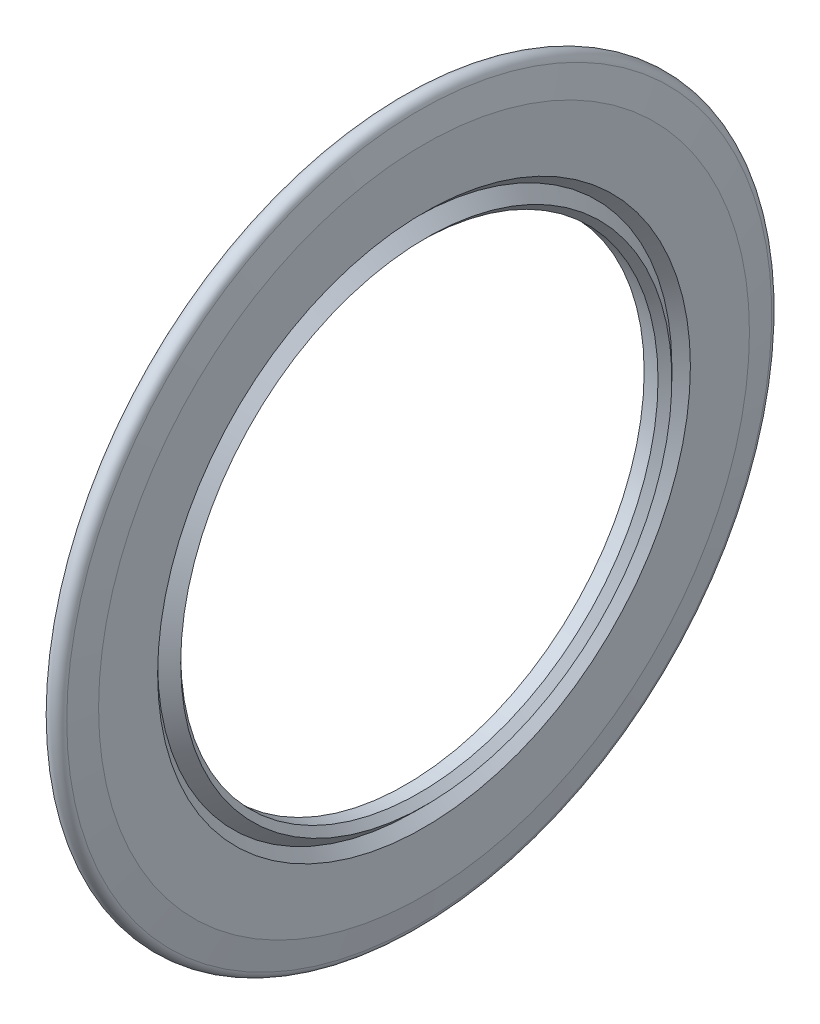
ISO-10303-21;
HEADER;
FILE_DESCRIPTION(('STEP AP214'),'2;1');
FILE_NAME('part.step','',(''),(''),'','','');
FILE_SCHEMA(('AUTOMOTIVE_DESIGN { 1 0 10303 214 1 1 1 1 }'));
ENDSEC;
DATA;
#1=APPLICATION_CONTEXT('core data for automotive mechanical design processes');
#2=APPLICATION_PROTOCOL_DEFINITION('international standard','automotive_design',2000,#1);
#3=PRODUCT_CONTEXT('',#1,'mechanical');
#4=PRODUCT('Part','Part','',(#3));
#5=PRODUCT_RELATED_PRODUCT_CATEGORY('part','',(#4));
#6=PRODUCT_DEFINITION_FORMATION('','',#4);
#7=PRODUCT_DEFINITION_CONTEXT('part definition',#1,'design');
#8=PRODUCT_DEFINITION('design','',#6,#7);
#9=PRODUCT_DEFINITION_SHAPE('','',#8);
#10=(LENGTH_UNIT() NAMED_UNIT(*) SI_UNIT(.MILLI.,.METRE.));
#11=(NAMED_UNIT(*) PLANE_ANGLE_UNIT() SI_UNIT($,.RADIAN.));
#12=(NAMED_UNIT(*) SI_UNIT($,.STERADIAN.) SOLID_ANGLE_UNIT());
#13=UNCERTAINTY_MEASURE_WITH_UNIT(LENGTH_MEASURE(1.E-05),#10,'distance_accuracy_value','');
#14=(GEOMETRIC_REPRESENTATION_CONTEXT(3) GLOBAL_UNCERTAINTY_ASSIGNED_CONTEXT((#13)) GLOBAL_UNIT_ASSIGNED_CONTEXT((#10,
#11,#12)) REPRESENTATION_CONTEXT('',''));
#15=CARTESIAN_POINT('',(0.,0.,0.));
#16=DIRECTION('',(0.,0.,1.));
#17=DIRECTION('',(1.,0.,0.));
#18=AXIS2_PLACEMENT_3D('',#15,#16,#17);
#19=CARTESIAN_POINT('',(0.14,0.,0.));
#20=DIRECTION('',(-1.,0.,0.));
#21=DIRECTION('',(0.,0.,1.));
#22=AXIS2_PLACEMENT_3D('',#19,#20,#21);
#23=CONICAL_SURFACE('',#22,10.0706,0.785398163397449);
#24=CARTESIAN_POINT('',(0.28,0.,0.));
#25=DIRECTION('',(-1.,0.,0.));
#26=DIRECTION('',(0.,0.,1.));
#27=AXIS2_PLACEMENT_3D('',#24,#25,#26);
#28=CIRCLE('',#27,9.9306);
#29=CARTESIAN_POINT('',(0.28,0.,9.9306));
#30=VERTEX_POINT('',#29);
#31=EDGE_CURVE('E10',#30,#30,#28,.T.);
#32=ORIENTED_EDGE('',*,*,#31,.F.);
#33=EDGE_LOOP('',(#32));
#34=FACE_BOUND('',#33,.T.);
#35=CARTESIAN_POINT('',(0.14,0.,0.));
#36=DIRECTION('',(-1.,0.,0.));
#37=DIRECTION('',(0.,0.,1.));
#38=AXIS2_PLACEMENT_3D('',#35,#36,#37);
#39=CIRCLE('',#38,10.0706);
#40=CARTESIAN_POINT('',(0.14,0.,10.0706));
#41=VERTEX_POINT('',#40);
#42=EDGE_CURVE('E80',#41,#41,#39,.T.);
#43=ORIENTED_EDGE('',*,*,#42,.T.);
#44=EDGE_LOOP('',(#43));
#45=FACE_BOUND('',#44,.T.);
#46=ADVANCED_FACE('F14',(#34,#45),#23,.F.);
#47=CARTESIAN_POINT('',(0.28,8.1856,0.));
#48=DIRECTION('',(-1.,0.,0.));
#49=DIRECTION('',(0.,0.,1.));
#50=AXIS2_PLACEMENT_3D('',#47,#48,#49);
#51=PLANE('',#50);
#52=ORIENTED_EDGE('',*,*,#31,.T.);
#53=EDGE_LOOP('',(#52));
#54=FACE_BOUND('',#53,.T.);
#55=CARTESIAN_POINT('',(0.28,0.,0.));
#56=DIRECTION('',(-1.,0.,0.));
#57=DIRECTION('',(0.,0.,1.));
#58=AXIS2_PLACEMENT_3D('',#55,#56,#57);
#59=CIRCLE('',#58,8.1856);
#60=CARTESIAN_POINT('',(0.28,0.,8.1856));
#61=VERTEX_POINT('',#60);
#62=EDGE_CURVE('E21',#61,#61,#59,.T.);
#63=ORIENTED_EDGE('',*,*,#62,.F.);
#64=EDGE_LOOP('',(#63));
#65=FACE_BOUND('',#64,.T.);
#66=ADVANCED_FACE('F99',(#54,#65),#51,.T.);
#67=CARTESIAN_POINT('',(0.14,0.,0.));
#68=DIRECTION('',(1.,0.,0.));
#69=DIRECTION('',(0.,0.,-1.));
#70=AXIS2_PLACEMENT_3D('',#67,#68,#69);
#71=CONICAL_SURFACE('',#70,8.0456,0.785398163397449);
#72=ORIENTED_EDGE('',*,*,#62,.T.);
#73=EDGE_LOOP('',(#72));
#74=FACE_BOUND('',#73,.T.);
#75=CARTESIAN_POINT('',(0.14,0.,0.));
#76=DIRECTION('',(-1.,0.,0.));
#77=DIRECTION('',(0.,0.,1.));
#78=AXIS2_PLACEMENT_3D('',#75,#76,#77);
#79=CIRCLE('',#78,8.0456);
#80=CARTESIAN_POINT('',(0.14,0.,8.0456));
#81=VERTEX_POINT('',#80);
#82=EDGE_CURVE('E30',#81,#81,#79,.T.);
#83=ORIENTED_EDGE('',*,*,#82,.F.);
#84=EDGE_LOOP('',(#83));
#85=FACE_BOUND('',#84,.T.);
#86=ADVANCED_FACE('F104',(#74,#85),#71,.T.);
#87=CARTESIAN_POINT('',(0.14,7.7756,0.));
#88=DIRECTION('',(-1.,0.,0.));
#89=DIRECTION('',(0.,0.,1.));
#90=AXIS2_PLACEMENT_3D('',#87,#88,#89);
#91=PLANE('',#90);
#92=ORIENTED_EDGE('',*,*,#82,.T.);
#93=EDGE_LOOP('',(#92));
#94=FACE_BOUND('',#93,.T.);
#95=CARTESIAN_POINT('',(0.14,0.,0.));
#96=DIRECTION('',(-1.,0.,0.));
#97=DIRECTION('',(0.,0.,1.));
#98=AXIS2_PLACEMENT_3D('',#95,#96,#97);
#99=CIRCLE('',#98,7.7756);
#100=CARTESIAN_POINT('',(0.14,0.,7.7756));
#101=VERTEX_POINT('',#100);
#102=EDGE_CURVE('E38',#101,#101,#99,.T.);
#103=ORIENTED_EDGE('',*,*,#102,.F.);
#104=EDGE_LOOP('',(#103));
#105=FACE_BOUND('',#104,.T.);
#106=ADVANCED_FACE('F108',(#94,#105),#91,.T.);
#107=CARTESIAN_POINT('',(0.14,0.,0.));
#108=DIRECTION('',(-1.,0.,0.));
#109=DIRECTION('',(0.,0.,1.));
#110=AXIS2_PLACEMENT_3D('',#107,#108,#109);
#111=CONICAL_SURFACE('',#110,7.7756,0.785398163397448);
#112=CARTESIAN_POINT('',(0.4889125,0.,0.));
#113=DIRECTION('',(-1.,0.,0.));
#114=DIRECTION('',(0.,0.,1.));
#115=AXIS2_PLACEMENT_3D('',#112,#113,#114);
#116=CIRCLE('',#115,7.4266875);
#117=CARTESIAN_POINT('',(0.4889125,0.,7.4266875));
#118=VERTEX_POINT('',#117);
#119=EDGE_CURVE('E44',#118,#118,#116,.T.);
#120=ORIENTED_EDGE('',*,*,#119,.F.);
#121=EDGE_LOOP('',(#120));
#122=FACE_BOUND('',#121,.T.);
#123=ORIENTED_EDGE('',*,*,#102,.T.);
#124=EDGE_LOOP('',(#123));
#125=FACE_BOUND('',#124,.T.);
#126=ADVANCED_FACE('F114',(#122,#125),#111,.F.);
#127=CARTESIAN_POINT('',(0.28,0.,0.));
#128=DIRECTION('',(1.,0.,0.));
#129=DIRECTION('',(0.,0.,-1.));
#130=AXIS2_PLACEMENT_3D('',#127,#128,#129);
#131=CONICAL_SURFACE('',#130,7.217775,0.78539816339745);
#132=ORIENTED_EDGE('',*,*,#119,.T.);
#133=EDGE_LOOP('',(#132));
#134=FACE_BOUND('',#133,.T.);
#135=CARTESIAN_POINT('',(0.28,0.,0.));
#136=DIRECTION('',(-1.,0.,0.));
#137=DIRECTION('',(0.,0.,1.));
#138=AXIS2_PLACEMENT_3D('',#135,#136,#137);
#139=CIRCLE('',#138,7.217775);
#140=CARTESIAN_POINT('',(0.28,0.,7.217775));
#141=VERTEX_POINT('',#140);
#142=EDGE_CURVE('E48',#141,#141,#139,.T.);
#143=ORIENTED_EDGE('',*,*,#142,.F.);
#144=EDGE_LOOP('',(#143));
#145=FACE_BOUND('',#144,.T.);
#146=ADVANCED_FACE('F118',(#134,#145),#131,.T.);
#147=CARTESIAN_POINT('',(0.14,0.,0.));
#148=DIRECTION('',(-1.,0.,0.));
#149=DIRECTION('',(0.,0.,1.));
#150=AXIS2_PLACEMENT_3D('',#147,#148,#149);
#151=CYLINDRICAL_SURFACE('',#150,7.217775);
#152=CARTESIAN_POINT('',(0.7,0.,0.));
#153=DIRECTION('',(-1.,0.,0.));
#154=DIRECTION('',(0.,0.,1.));
#155=AXIS2_PLACEMENT_3D('',#152,#153,#154);
#156=CIRCLE('',#155,7.217775);
#157=CARTESIAN_POINT('',(0.7,0.,7.217775));
#158=VERTEX_POINT('',#157);
#159=EDGE_CURVE('E52',#158,#158,#156,.T.);
#160=ORIENTED_EDGE('',*,*,#159,.F.);
#161=EDGE_LOOP('',(#160));
#162=FACE_BOUND('',#161,.T.);
#163=ORIENTED_EDGE('',*,*,#142,.T.);
#164=EDGE_LOOP('',(#163));
#165=FACE_BOUND('',#164,.T.);
#166=ADVANCED_FACE('F122',(#162,#165),#151,.F.);
#167=CARTESIAN_POINT('',(0.7,0.,0.));
#168=DIRECTION('',(1.,0.,0.));
#169=DIRECTION('',(0.,0.,-1.));
#170=AXIS2_PLACEMENT_3D('',#167,#168,#169);
#171=CONICAL_SURFACE('',#170,7.217775,0.785398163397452);
#172=CARTESIAN_POINT('',(0.9089125,0.,0.));
#173=DIRECTION('',(-1.,0.,0.));
#174=DIRECTION('',(0.,0.,1.));
#175=AXIS2_PLACEMENT_3D('',#172,#173,#174);
#176=CIRCLE('',#175,7.4266875);
#177=CARTESIAN_POINT('',(0.9089125,0.,7.4266875));
#178=VERTEX_POINT('',#177);
#179=EDGE_CURVE('E56',#178,#178,#176,.T.);
#180=ORIENTED_EDGE('',*,*,#179,.F.);
#181=EDGE_LOOP('',(#180));
#182=FACE_BOUND('',#181,.T.);
#183=ORIENTED_EDGE('',*,*,#159,.T.);
#184=EDGE_LOOP('',(#183));
#185=FACE_BOUND('',#184,.T.);
#186=ADVANCED_FACE('F126',(#182,#185),#171,.F.);
#187=CARTESIAN_POINT('',(0.56,0.,0.));
#188=DIRECTION('',(-1.,0.,0.));
#189=DIRECTION('',(0.,0.,1.));
#190=AXIS2_PLACEMENT_3D('',#187,#188,#189);
#191=CONICAL_SURFACE('',#190,7.7756,0.785398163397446);
#192=ORIENTED_EDGE('',*,*,#179,.T.);
#193=EDGE_LOOP('',(#192));
#194=FACE_BOUND('',#193,.T.);
#195=CARTESIAN_POINT('',(0.56,0.,0.));
#196=DIRECTION('',(-1.,0.,0.));
#197=DIRECTION('',(0.,0.,1.));
#198=AXIS2_PLACEMENT_3D('',#195,#196,#197);
#199=CIRCLE('',#198,7.7756);
#200=CARTESIAN_POINT('',(0.56,0.,7.7756));
#201=VERTEX_POINT('',#200);
#202=EDGE_CURVE('E60',#201,#201,#199,.T.);
#203=ORIENTED_EDGE('',*,*,#202,.F.);
#204=EDGE_LOOP('',(#203));
#205=FACE_BOUND('',#204,.T.);
#206=ADVANCED_FACE('F130',(#194,#205),#191,.T.);
#207=CARTESIAN_POINT('',(0.56,0.,0.));
#208=DIRECTION('',(1.,0.,0.));
#209=DIRECTION('',(0.,0.,-1.));
#210=AXIS2_PLACEMENT_3D('',#207,#208,#209);
#211=CONICAL_SURFACE('',#210,7.7756,0.785398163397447);
#212=CARTESIAN_POINT('',(0.84,0.,0.));
#213=DIRECTION('',(-1.,0.,0.));
#214=DIRECTION('',(0.,0.,1.));
#215=AXIS2_PLACEMENT_3D('',#212,#213,#214);
#216=CIRCLE('',#215,8.0556);
#217=CARTESIAN_POINT('',(0.84,0.,8.0556));
#218=VERTEX_POINT('',#217);
#219=EDGE_CURVE('E64',#218,#218,#216,.T.);
#220=ORIENTED_EDGE('',*,*,#219,.F.);
#221=EDGE_LOOP('',(#220));
#222=FACE_BOUND('',#221,.T.);
#223=ORIENTED_EDGE('',*,*,#202,.T.);
#224=EDGE_LOOP('',(#223));
#225=FACE_BOUND('',#224,.T.);
#226=ADVANCED_FACE('F134',(#222,#225),#211,.F.);
#227=CARTESIAN_POINT('',(0.84,9.84111737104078,0.));
#228=DIRECTION('',(1.,0.,0.));
#229=DIRECTION('',(0.,0.,-1.));
#230=AXIS2_PLACEMENT_3D('',#227,#228,#229);
#231=PLANE('',#230);
#232=ORIENTED_EDGE('',*,*,#219,.T.);
#233=EDGE_LOOP('',(#232));
#234=FACE_BOUND('',#233,.T.);
#235=CARTESIAN_POINT('',(0.84,0.,0.));
#236=DIRECTION('',(-1.,0.,0.));
#237=DIRECTION('',(0.,0.,1.));
#238=AXIS2_PLACEMENT_3D('',#235,#236,#237);
#239=CIRCLE('',#238,9.84111737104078);
#240=CARTESIAN_POINT('',(0.84,0.,9.84111737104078));
#241=VERTEX_POINT('',#240);
#242=EDGE_CURVE('E68',#241,#241,#239,.T.);
#243=ORIENTED_EDGE('',*,*,#242,.F.);
#244=EDGE_LOOP('',(#243));
#245=FACE_BOUND('',#244,.T.);
#246=ADVANCED_FACE('F138',(#234,#245),#231,.T.);
#247=CARTESIAN_POINT('',(0.84,0.,0.));
#248=DIRECTION('',(-1.,0.,0.));
#249=DIRECTION('',(0.,0.,1.));
#250=AXIS2_PLACEMENT_3D('',#247,#248,#249);
#251=CONICAL_SURFACE('',#250,9.84111737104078,1.39626340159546);
#252=CARTESIAN_POINT('',(0.695746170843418,0.,0.));
#253=DIRECTION('',(-1.,0.,0.));
#254=DIRECTION('',(0.,0.,1.));
#255=AXIS2_PLACEMENT_3D('',#252,#253,#254);
#256=CIRCLE('',#255,10.6592214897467);
#257=CARTESIAN_POINT('',(0.695746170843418,0.,10.6592214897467));
#258=VERTEX_POINT('',#257);
#259=EDGE_CURVE('E72',#258,#258,#256,.T.);
#260=ORIENTED_EDGE('',*,*,#259,.F.);
#261=EDGE_LOOP('',(#260));
#262=FACE_BOUND('',#261,.T.);
#263=ORIENTED_EDGE('',*,*,#242,.T.);
#264=EDGE_LOOP('',(#263));
#265=FACE_BOUND('',#264,.T.);
#266=ADVANCED_FACE('F95',(#262,#265),#251,.T.);
#267=CARTESIAN_POINT('',(0.42,0.,0.));
#268=DIRECTION('',(-1.,0.,0.));
#269=DIRECTION('',(0.,0.,1.));
#270=AXIS2_PLACEMENT_3D('',#267,#268,#269);
#271=TOROIDAL_SURFACE('',#270,10.6106,0.28);
#272=CARTESIAN_POINT('',(0.14,0.,0.));
#273=DIRECTION('',(-1.,0.,0.));
#274=DIRECTION('',(0.,0.,1.));
#275=AXIS2_PLACEMENT_3D('',#272,#273,#274);
#276=CIRCLE('',#275,10.6106);
#277=CARTESIAN_POINT('',(0.14,0.,10.6106));
#278=VERTEX_POINT('',#277);
#279=EDGE_CURVE('E76',#278,#278,#276,.T.);
#280=ORIENTED_EDGE('',*,*,#279,.F.);
#281=EDGE_LOOP('',(#280));
#282=FACE_BOUND('',#281,.T.);
#283=ORIENTED_EDGE('',*,*,#259,.T.);
#284=EDGE_LOOP('',(#283));
#285=FACE_BOUND('',#284,.T.);
#286=ADVANCED_FACE('F88',(#282,#285),#271,.T.);
#287=CARTESIAN_POINT('',(0.14,10.0706,0.));
#288=DIRECTION('',(-1.,0.,0.));
#289=DIRECTION('',(0.,0.,1.));
#290=AXIS2_PLACEMENT_3D('',#287,#288,#289);
#291=PLANE('',#290);
#292=ORIENTED_EDGE('',*,*,#279,.T.);
#293=EDGE_LOOP('',(#292));
#294=FACE_BOUND('',#293,.T.);
#295=ORIENTED_EDGE('',*,*,#42,.F.);
#296=EDGE_LOOP('',(#295));
#297=FACE_BOUND('',#296,.T.);
#298=ADVANCED_FACE('F86',(#294,#297),#291,.T.);
#299=CLOSED_SHELL('',(#46,#66,#86,#106,#126,#146,#166,#186,#206,#226,#246,#266,#286,#298));
#300=MANIFOLD_SOLID_BREP('B1',#299);
#301=ADVANCED_BREP_SHAPE_REPRESENTATION('',(#18,#300),#14);
#302=SHAPE_DEFINITION_REPRESENTATION(#9,#301);
ENDSEC;
END-ISO-10303-21;
